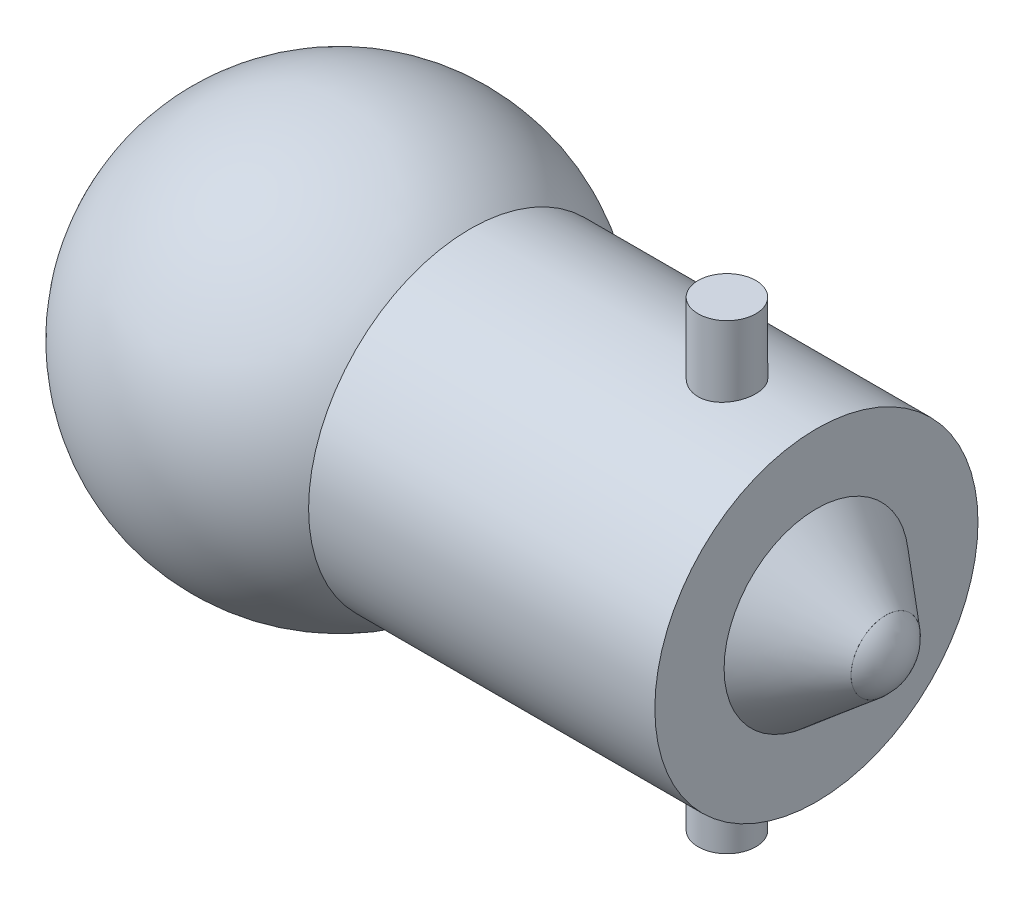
from build123d import *

# Parameters (mm, degrees)
ESQUISSE2_R           = 7
EXTRUSION1_DEPTH      = 15
EXTRUSION2_DEPTH      = 10
EXTRUSION2_DEPTH_BACK = 10
ESQUISSE6_R           = 1.25


with BuildPart() as part:
    # Esquisse2 → Extrusion1 (new body)
    with BuildSketch(Plane(origin=(0, 0, 0), x_dir=(0, 0, -1), z_dir=(1, 0, 0))):
        Circle(ESQUISSE2_R)
    extrude(amount=-EXTRUSION1_DEPTH)

    # Esquisse3 → R_volution1 (revolve)
    with BuildSketch(Plane.XY):
        with BuildLine():
            Line((-29.656854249, 0), (-11.656854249, 0))
            ThreePointArc((-11.656854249, 0), (-20.656854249, -9), (-29.656854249, 0))
        make_face()
    revolve(axis=Axis((-29.656854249, 0, 0), (1, 0, 0)))

    # Esquisse4 → R_volution2 (revolve)
    with BuildSketch(Plane.XY, mode=Mode.PRIVATE) as r_volution2_sk:
        Polygon((0, 0), (0, -4), (3, -1.5), (3, 0), align=None)
    revolve(r_volution2_sk.sketch.rotate(Axis((-2.952542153, 0, 0), (1, 0, 0)), 180), axis=Axis((-2.952542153, 0, 0), (1, 0, 0)))

    # Esquisse5 → R_volution3 (revolve)
    with BuildSketch(Plane.XY):
        with BuildLine():
            Line((-0.32409987, 0), (3.67590013, 0))
            ThreePointArc((3.67590013, 0), (1.67590013, -2), (-0.32409987, 0))
        make_face()
    revolve(axis=Axis((-2.064421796, 0, 0), (1, 0, 0)))

    # Esquisse6 → Extrusion2 (add, two sides: drawn at the far end of the back side and taken through both)
    with BuildSketch(Plane(origin=(0, 0, 0), x_dir=(1, 0, 0), z_dir=(0, 1, 0)).offset(-EXTRUSION2_DEPTH_BACK)):
        with Locations(Location((-3.875, 0, 0), (0, 0, 90))):
            Circle(ESQUISSE6_R)
    extrude(amount=EXTRUSION2_DEPTH + EXTRUSION2_DEPTH_BACK)


solid = part.part
